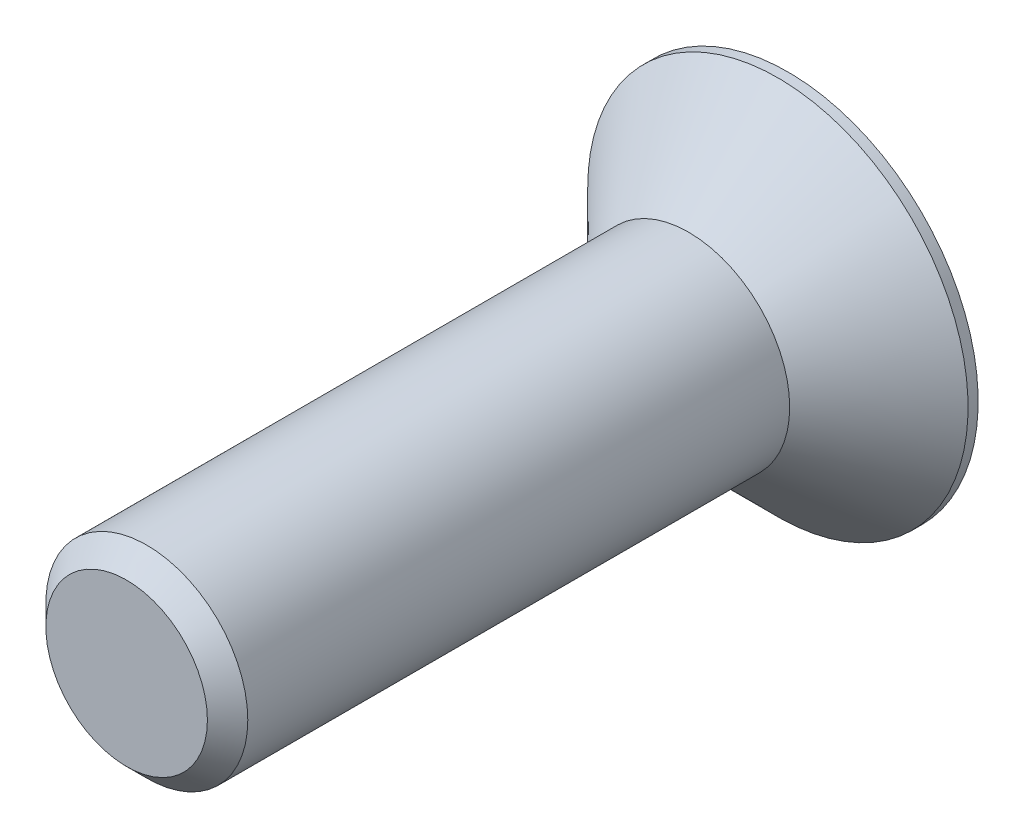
from build123d import *

# Parameters (mm, degrees)
FENTE1_DEPTH    = 2.8
ESQUISSE3_W     = 3
ESQUISSE3_H     = 16.7
CHANFREIN1_SIZE = 0.6


with BuildPart() as part:
    # Esquisse1 → Base-R_volution (revolve)
    with BuildSketch(Plane(origin=(0, 0, 0), x_dir=(1, 0, 0), z_dir=(0, 1, 0)), mode=Mode.PRIVATE) as base_r_volution_sk:
        Polygon((3, 0), (5.65, 2.65), (5.65, 2.95), (0, 2.95), (0, 2.65), (0, 0), align=None)
    revolve(base_r_volution_sk.sketch.rotate(Axis((0, 0, 0), (0, 0, -1)), 180), axis=Axis((0, 0, 0), (0, 0, -1)))

    # Esquisse2 → fente1 (cut)
    with BuildSketch(Plane.XY.offset(-2.95)):
        Polygon((2, -1.154700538), (2, 1.154700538), (0, 2.309401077), (-2, 1.154700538), (-2, -1.154700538), (0, -2.309401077), align=None)
    extrude(amount=FENTE1_DEPTH, mode=Mode.SUBTRACT)

    # Esquisse3 → Boss.-R_vol.1 (revolve)
    with BuildSketch(Plane(origin=(0, 0, 0), x_dir=(1, 0, 0), z_dir=(0, 1, 0))):
        with Locations((1.5, -8.35)):
            Rectangle(ESQUISSE3_W, ESQUISSE3_H)
    revolve(axis=Axis((0, 0, 0), (0, 0, 1)))

    # Chanfrein1
    chanfrein1_edges = [part.edges().sort_by_distance(p)[0] for p in [
        (-3, 0, 16.7),
    ]]
    chamfer(chanfrein1_edges, length=CHANFREIN1_SIZE)


solid = part.part
